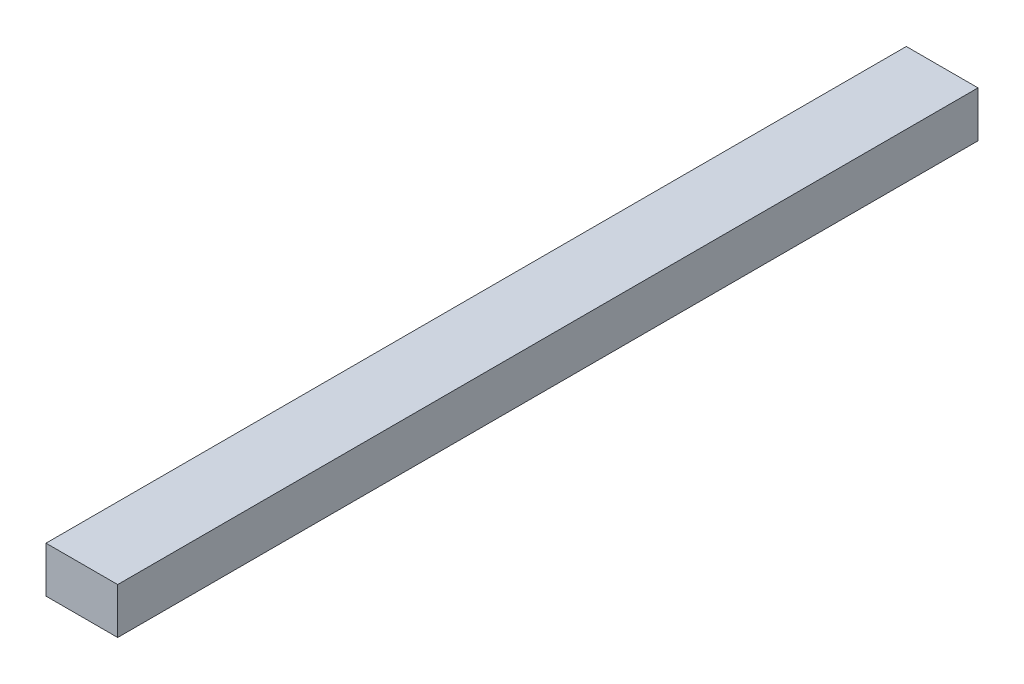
ISO-10303-21;
HEADER;
FILE_DESCRIPTION(('STEP AP214'),'2;1');
FILE_NAME('part.step','',(''),(''),'','','');
FILE_SCHEMA(('AUTOMOTIVE_DESIGN { 1 0 10303 214 1 1 1 1 }'));
ENDSEC;
DATA;
#1=APPLICATION_CONTEXT('core data for automotive mechanical design processes');
#2=APPLICATION_PROTOCOL_DEFINITION('international standard','automotive_design',2000,#1);
#3=PRODUCT_CONTEXT('',#1,'mechanical');
#4=PRODUCT('Part','Part','',(#3));
#5=PRODUCT_RELATED_PRODUCT_CATEGORY('part','',(#4));
#6=PRODUCT_DEFINITION_FORMATION('','',#4);
#7=PRODUCT_DEFINITION_CONTEXT('part definition',#1,'design');
#8=PRODUCT_DEFINITION('design','',#6,#7);
#9=PRODUCT_DEFINITION_SHAPE('','',#8);
#10=(LENGTH_UNIT() NAMED_UNIT(*) SI_UNIT(.MILLI.,.METRE.));
#11=(NAMED_UNIT(*) PLANE_ANGLE_UNIT() SI_UNIT($,.RADIAN.));
#12=(NAMED_UNIT(*) SI_UNIT($,.STERADIAN.) SOLID_ANGLE_UNIT());
#13=UNCERTAINTY_MEASURE_WITH_UNIT(LENGTH_MEASURE(1.E-05),#10,'distance_accuracy_value','');
#14=(GEOMETRIC_REPRESENTATION_CONTEXT(3) GLOBAL_UNCERTAINTY_ASSIGNED_CONTEXT((#13)) GLOBAL_UNIT_ASSIGNED_CONTEXT((#10,
#11,#12)) REPRESENTATION_CONTEXT('',''));
#15=CARTESIAN_POINT('',(0.,0.,0.));
#16=DIRECTION('',(0.,0.,1.));
#17=DIRECTION('',(1.,0.,0.));
#18=AXIS2_PLACEMENT_3D('',#15,#16,#17);
#19=CARTESIAN_POINT('',(-27.5,-17.5,-300.));
#20=DIRECTION('',(0.,0.,1.));
#21=DIRECTION('',(1.,0.,0.));
#22=AXIS2_PLACEMENT_3D('',#19,#20,#21);
#23=PLANE('',#22);
#24=DIRECTION('',(-1.,0.,0.));
#25=VECTOR('',#24,1.);
#26=CARTESIAN_POINT('',(25.,16.,-300.));
#27=LINE('',#26,#25);
#28=CARTESIAN_POINT('',(25.,16.,-300.));
#29=VERTEX_POINT('',#28);
#30=CARTESIAN_POINT('',(-25.,16.,-300.));
#31=VERTEX_POINT('',#30);
#32=EDGE_CURVE('E59',#29,#31,#27,.T.);
#33=ORIENTED_EDGE('',*,*,#32,.F.);
#34=DIRECTION('',(0.,1.,0.));
#35=VECTOR('',#34,1.);
#36=CARTESIAN_POINT('',(25.,-16.,-300.));
#37=LINE('',#36,#35);
#38=CARTESIAN_POINT('',(25.,-16.,-300.));
#39=VERTEX_POINT('',#38);
#40=EDGE_CURVE('E83',#39,#29,#37,.T.);
#41=ORIENTED_EDGE('',*,*,#40,.F.);
#42=DIRECTION('',(1.,0.,0.));
#43=VECTOR('',#42,1.);
#44=CARTESIAN_POINT('',(-25.,-16.,-300.));
#45=LINE('',#44,#43);
#46=CARTESIAN_POINT('',(-25.,-16.,-300.));
#47=VERTEX_POINT('',#46);
#48=EDGE_CURVE('E99',#47,#39,#45,.T.);
#49=ORIENTED_EDGE('',*,*,#48,.F.);
#50=DIRECTION('',(0.,-1.,0.));
#51=VECTOR('',#50,1.);
#52=CARTESIAN_POINT('',(-25.,16.,-300.));
#53=LINE('',#52,#51);
#54=EDGE_CURVE('E97',#31,#47,#53,.T.);
#55=ORIENTED_EDGE('',*,*,#54,.F.);
#56=EDGE_LOOP('',(#33,#41,#49,#55));
#57=FACE_BOUND('',#56,.T.);
#58=ADVANCED_FACE('F35',(#57),#23,.F.);
#59=CARTESIAN_POINT('',(25.,16.,-300.));
#60=DIRECTION('',(0.,1.,0.));
#61=DIRECTION('',(-1.,0.,0.));
#62=AXIS2_PLACEMENT_3D('',#59,#60,#61);
#63=PLANE('',#62);
#64=DIRECTION('',(0.,0.,1.));
#65=VECTOR('',#64,1.);
#66=CARTESIAN_POINT('',(25.,16.,-300.));
#67=LINE('',#66,#65);
#68=CARTESIAN_POINT('',(25.,16.,300.));
#69=VERTEX_POINT('',#68);
#70=EDGE_CURVE('E11',#29,#69,#67,.T.);
#71=ORIENTED_EDGE('',*,*,#70,.F.);
#72=ORIENTED_EDGE('',*,*,#32,.T.);
#73=DIRECTION('',(0.,0.,1.));
#74=VECTOR('',#73,1.);
#75=CARTESIAN_POINT('',(-25.,16.,-300.));
#76=LINE('',#75,#74);
#77=CARTESIAN_POINT('',(-25.,16.,300.));
#78=VERTEX_POINT('',#77);
#79=EDGE_CURVE('E38',#31,#78,#76,.T.);
#80=ORIENTED_EDGE('',*,*,#79,.T.);
#81=DIRECTION('',(-1.,0.,0.));
#82=VECTOR('',#81,1.);
#83=CARTESIAN_POINT('',(25.,16.,300.));
#84=LINE('',#83,#82);
#85=EDGE_CURVE('E77',#69,#78,#84,.T.);
#86=ORIENTED_EDGE('',*,*,#85,.F.);
#87=EDGE_LOOP('',(#71,#72,#80,#86));
#88=FACE_BOUND('',#87,.T.);
#89=ADVANCED_FACE('F75',(#88),#63,.T.);
#90=CARTESIAN_POINT('',(25.,-16.,-300.));
#91=DIRECTION('',(1.,0.,0.));
#92=DIRECTION('',(0.,1.,0.));
#93=AXIS2_PLACEMENT_3D('',#90,#91,#92);
#94=PLANE('',#93);
#95=DIRECTION('',(0.,0.,1.));
#96=VECTOR('',#95,1.);
#97=CARTESIAN_POINT('',(25.,-16.,-300.));
#98=LINE('',#97,#96);
#99=CARTESIAN_POINT('',(25.,-16.,300.));
#100=VERTEX_POINT('',#99);
#101=EDGE_CURVE('E43',#39,#100,#98,.T.);
#102=ORIENTED_EDGE('',*,*,#101,.F.);
#103=ORIENTED_EDGE('',*,*,#40,.T.);
#104=ORIENTED_EDGE('',*,*,#70,.T.);
#105=DIRECTION('',(0.,1.,0.));
#106=VECTOR('',#105,1.);
#107=CARTESIAN_POINT('',(25.,-16.,300.));
#108=LINE('',#107,#106);
#109=EDGE_CURVE('E91',#100,#69,#108,.T.);
#110=ORIENTED_EDGE('',*,*,#109,.F.);
#111=EDGE_LOOP('',(#102,#103,#104,#110));
#112=FACE_BOUND('',#111,.T.);
#113=ADVANCED_FACE('F108',(#112),#94,.T.);
#114=CARTESIAN_POINT('',(-25.,-16.,-300.));
#115=DIRECTION('',(0.,-1.,0.));
#116=DIRECTION('',(0.,0.,-1.));
#117=AXIS2_PLACEMENT_3D('',#114,#115,#116);
#118=PLANE('',#117);
#119=DIRECTION('',(0.,0.,1.));
#120=VECTOR('',#119,1.);
#121=CARTESIAN_POINT('',(-25.,-16.,-300.));
#122=LINE('',#121,#120);
#123=CARTESIAN_POINT('',(-25.,-16.,300.));
#124=VERTEX_POINT('',#123);
#125=EDGE_CURVE('E82',#47,#124,#122,.T.);
#126=ORIENTED_EDGE('',*,*,#125,.F.);
#127=ORIENTED_EDGE('',*,*,#48,.T.);
#128=ORIENTED_EDGE('',*,*,#101,.T.);
#129=DIRECTION('',(1.,0.,0.));
#130=VECTOR('',#129,1.);
#131=CARTESIAN_POINT('',(-25.,-16.,300.));
#132=LINE('',#131,#130);
#133=EDGE_CURVE('E51',#124,#100,#132,.T.);
#134=ORIENTED_EDGE('',*,*,#133,.F.);
#135=EDGE_LOOP('',(#126,#127,#128,#134));
#136=FACE_BOUND('',#135,.T.);
#137=ADVANCED_FACE('F104',(#136),#118,.T.);
#138=CARTESIAN_POINT('',(-25.,16.,-300.));
#139=DIRECTION('',(-1.,0.,0.));
#140=DIRECTION('',(0.,-1.,0.));
#141=AXIS2_PLACEMENT_3D('',#138,#139,#140);
#142=PLANE('',#141);
#143=ORIENTED_EDGE('',*,*,#79,.F.);
#144=ORIENTED_EDGE('',*,*,#54,.T.);
#145=ORIENTED_EDGE('',*,*,#125,.T.);
#146=DIRECTION('',(0.,-1.,0.));
#147=VECTOR('',#146,1.);
#148=CARTESIAN_POINT('',(-25.,16.,300.));
#149=LINE('',#148,#147);
#150=EDGE_CURVE('E85',#78,#124,#149,.T.);
#151=ORIENTED_EDGE('',*,*,#150,.F.);
#152=EDGE_LOOP('',(#143,#144,#145,#151));
#153=FACE_BOUND('',#152,.T.);
#154=ADVANCED_FACE('F86',(#153),#142,.T.);
#155=CARTESIAN_POINT('',(-27.5,-17.5,300.));
#156=DIRECTION('',(0.,0.,1.));
#157=DIRECTION('',(1.,0.,0.));
#158=AXIS2_PLACEMENT_3D('',#155,#156,#157);
#159=PLANE('',#158);
#160=ORIENTED_EDGE('',*,*,#109,.T.);
#161=ORIENTED_EDGE('',*,*,#85,.T.);
#162=ORIENTED_EDGE('',*,*,#150,.T.);
#163=ORIENTED_EDGE('',*,*,#133,.T.);
#164=EDGE_LOOP('',(#160,#161,#162,#163));
#165=FACE_BOUND('',#164,.T.);
#166=ADVANCED_FACE('F89',(#165),#159,.T.);
#167=CLOSED_SHELL('',(#58,#89,#113,#137,#154,#166));
#168=MANIFOLD_SOLID_BREP('B2',#167);
#169=ADVANCED_BREP_SHAPE_REPRESENTATION('',(#18,#168),#14);
#170=SHAPE_DEFINITION_REPRESENTATION(#9,#169);
ENDSEC;
END-ISO-10303-21;
